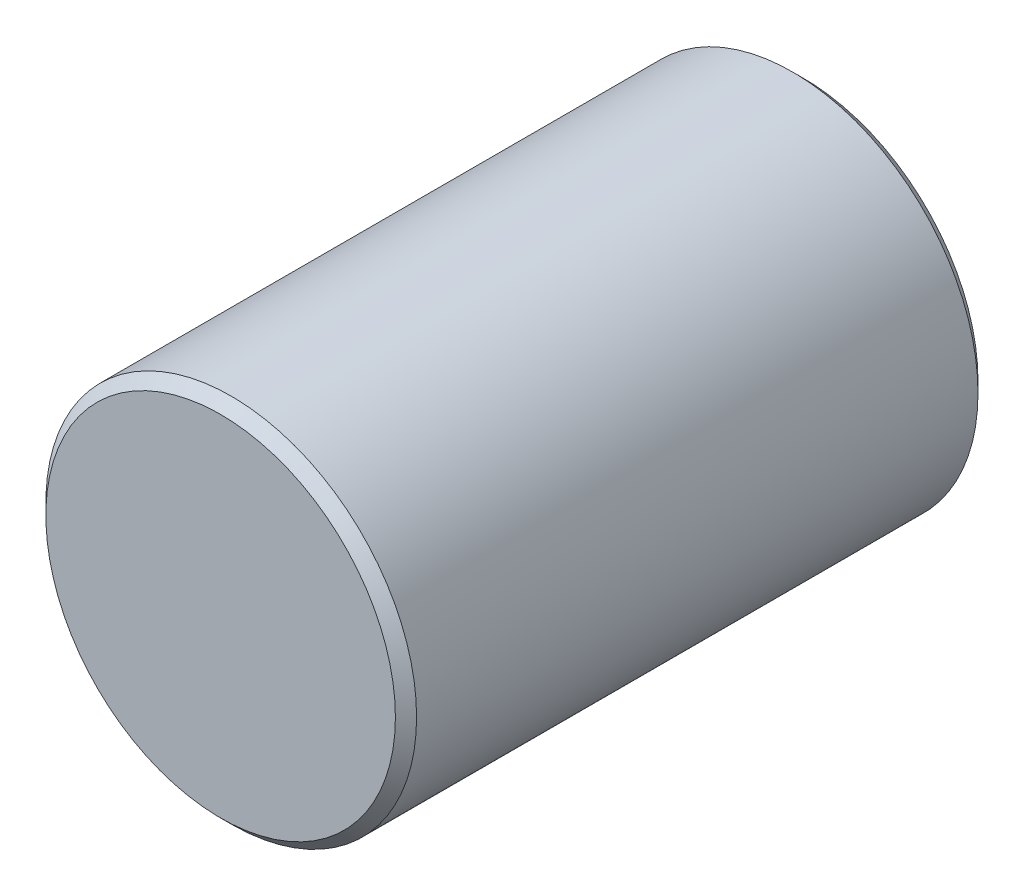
ISO-10303-21;
HEADER;
FILE_DESCRIPTION(('STEP AP214'),'2;1');
FILE_NAME('part.step','',(''),(''),'','','');
FILE_SCHEMA(('AUTOMOTIVE_DESIGN { 1 0 10303 214 1 1 1 1 }'));
ENDSEC;
DATA;
#1=APPLICATION_CONTEXT('core data for automotive mechanical design processes');
#2=APPLICATION_PROTOCOL_DEFINITION('international standard','automotive_design',2000,#1);
#3=PRODUCT_CONTEXT('',#1,'mechanical');
#4=PRODUCT('Part','Part','',(#3));
#5=PRODUCT_RELATED_PRODUCT_CATEGORY('part','',(#4));
#6=PRODUCT_DEFINITION_FORMATION('','',#4);
#7=PRODUCT_DEFINITION_CONTEXT('part definition',#1,'design');
#8=PRODUCT_DEFINITION('design','',#6,#7);
#9=PRODUCT_DEFINITION_SHAPE('','',#8);
#10=(LENGTH_UNIT() NAMED_UNIT(*) SI_UNIT(.MILLI.,.METRE.));
#11=(NAMED_UNIT(*) PLANE_ANGLE_UNIT() SI_UNIT($,.RADIAN.));
#12=(NAMED_UNIT(*) SI_UNIT($,.STERADIAN.) SOLID_ANGLE_UNIT());
#13=UNCERTAINTY_MEASURE_WITH_UNIT(LENGTH_MEASURE(1.E-05),#10,'distance_accuracy_value','');
#14=(GEOMETRIC_REPRESENTATION_CONTEXT(3) GLOBAL_UNCERTAINTY_ASSIGNED_CONTEXT((#13)) GLOBAL_UNIT_ASSIGNED_CONTEXT((#10,
#11,#12)) REPRESENTATION_CONTEXT('',''));
#15=CARTESIAN_POINT('',(0.,0.,0.));
#16=DIRECTION('',(0.,0.,1.));
#17=DIRECTION('',(1.,0.,0.));
#18=AXIS2_PLACEMENT_3D('',#15,#16,#17);
#19=CARTESIAN_POINT('',(0.,0.,55.));
#20=DIRECTION('',(0.,0.,-1.));
#21=DIRECTION('',(-1.,0.,0.));
#22=AXIS2_PLACEMENT_3D('',#19,#20,#21);
#23=CYLINDRICAL_SURFACE('',#22,17.5);
#24=CARTESIAN_POINT('',(0.,0.,1.00000000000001));
#25=DIRECTION('',(0.,0.,1.));
#26=DIRECTION('',(1.,0.,0.));
#27=AXIS2_PLACEMENT_3D('',#24,#25,#26);
#28=CIRCLE('',#27,17.5);
#29=CARTESIAN_POINT('',(17.5,0.,1.00000000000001));
#30=VERTEX_POINT('',#29);
#31=EDGE_CURVE('E69',#30,#30,#28,.T.);
#32=ORIENTED_EDGE('',*,*,#31,.T.);
#33=EDGE_LOOP('',(#32));
#34=FACE_BOUND('',#33,.T.);
#35=CARTESIAN_POINT('',(0.,0.,54.));
#36=DIRECTION('',(0.,0.,1.));
#37=DIRECTION('',(1.,0.,0.));
#38=AXIS2_PLACEMENT_3D('',#35,#36,#37);
#39=CIRCLE('',#38,17.5);
#40=CARTESIAN_POINT('',(17.5,0.,54.));
#41=VERTEX_POINT('',#40);
#42=EDGE_CURVE('E63',#41,#41,#39,.F.);
#43=ORIENTED_EDGE('',*,*,#42,.T.);
#44=EDGE_LOOP('',(#43));
#45=FACE_BOUND('',#44,.T.);
#46=ADVANCED_FACE('F38',(#34,#45),#23,.T.);
#47=CARTESIAN_POINT('',(0.,0.,55.));
#48=DIRECTION('',(0.,0.,1.));
#49=DIRECTION('',(1.,0.,0.));
#50=AXIS2_PLACEMENT_3D('',#47,#48,#49);
#51=PLANE('',#50);
#52=CARTESIAN_POINT('',(0.,0.,55.));
#53=DIRECTION('',(0.,0.,1.));
#54=DIRECTION('',(1.,0.,0.));
#55=AXIS2_PLACEMENT_3D('',#52,#53,#54);
#56=CIRCLE('',#55,16.5);
#57=CARTESIAN_POINT('',(16.5,0.,55.));
#58=VERTEX_POINT('',#57);
#59=EDGE_CURVE('E11',#58,#58,#56,.T.);
#60=ORIENTED_EDGE('',*,*,#59,.T.);
#61=EDGE_LOOP('',(#60));
#62=FACE_BOUND('',#61,.T.);
#63=ADVANCED_FACE('F85',(#62),#51,.T.);
#64=CARTESIAN_POINT('',(0.,0.,0.));
#65=DIRECTION('',(0.,0.,1.));
#66=DIRECTION('',(1.,0.,0.));
#67=AXIS2_PLACEMENT_3D('',#64,#65,#66);
#68=PLANE('',#67);
#69=CARTESIAN_POINT('',(0.,0.,0.));
#70=DIRECTION('',(0.,0.,-1.));
#71=DIRECTION('',(-1.,0.,0.));
#72=AXIS2_PLACEMENT_3D('',#69,#70,#71);
#73=CIRCLE('',#72,2.49999999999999);
#74=CARTESIAN_POINT('',(-2.49999999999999,0.,0.));
#75=VERTEX_POINT('',#74);
#76=EDGE_CURVE('E59',#75,#75,#73,.T.);
#77=ORIENTED_EDGE('',*,*,#76,.F.);
#78=EDGE_LOOP('',(#77));
#79=FACE_BOUND('',#78,.T.);
#80=CARTESIAN_POINT('',(0.,0.,0.));
#81=DIRECTION('',(0.,0.,1.));
#82=DIRECTION('',(1.,0.,0.));
#83=AXIS2_PLACEMENT_3D('',#80,#81,#82);
#84=CIRCLE('',#83,16.5);
#85=CARTESIAN_POINT('',(16.5,0.,0.));
#86=VERTEX_POINT('',#85);
#87=EDGE_CURVE('E46',#86,#86,#84,.F.);
#88=ORIENTED_EDGE('',*,*,#87,.T.);
#89=EDGE_LOOP('',(#88));
#90=FACE_BOUND('',#89,.T.);
#91=ADVANCED_FACE('F76',(#79,#90),#68,.F.);
#92=CARTESIAN_POINT('',(0.,0.,1.00000000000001));
#93=DIRECTION('',(0.,0.,1.));
#94=DIRECTION('',(1.,0.,0.));
#95=AXIS2_PLACEMENT_3D('',#92,#93,#94);
#96=CONICAL_SURFACE('',#95,17.5,0.785398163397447);
#97=ORIENTED_EDGE('',*,*,#87,.F.);
#98=EDGE_LOOP('',(#97));
#99=FACE_BOUND('',#98,.T.);
#100=ORIENTED_EDGE('',*,*,#31,.F.);
#101=EDGE_LOOP('',(#100));
#102=FACE_BOUND('',#101,.T.);
#103=ADVANCED_FACE('F78',(#99,#102),#96,.T.);
#104=CARTESIAN_POINT('',(0.,0.,55.));
#105=DIRECTION('',(0.,0.,-1.));
#106=DIRECTION('',(-1.,0.,0.));
#107=AXIS2_PLACEMENT_3D('',#104,#105,#106);
#108=CONICAL_SURFACE('',#107,16.5,0.785398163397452);
#109=ORIENTED_EDGE('',*,*,#42,.F.);
#110=EDGE_LOOP('',(#109));
#111=FACE_BOUND('',#110,.T.);
#112=ORIENTED_EDGE('',*,*,#59,.F.);
#113=EDGE_LOOP('',(#112));
#114=FACE_BOUND('',#113,.T.);
#115=ADVANCED_FACE('F40',(#111,#114),#108,.T.);
#116=CARTESIAN_POINT('',(0.,0.,0.));
#117=DIRECTION('',(0.,0.,-1.));
#118=DIRECTION('',(-1.,0.,0.));
#119=AXIS2_PLACEMENT_3D('',#116,#117,#118);
#120=CYLINDRICAL_SURFACE('',#119,2.49999999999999);
#121=CARTESIAN_POINT('',(0.,0.,15.));
#122=DIRECTION('',(0.,0.,-1.));
#123=DIRECTION('',(-1.,0.,0.));
#124=AXIS2_PLACEMENT_3D('',#121,#122,#123);
#125=CIRCLE('',#124,2.49999999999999);
#126=CARTESIAN_POINT('',(-2.49999999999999,0.,15.));
#127=VERTEX_POINT('',#126);
#128=EDGE_CURVE('E56',#127,#127,#125,.T.);
#129=ORIENTED_EDGE('',*,*,#128,.F.);
#130=EDGE_LOOP('',(#129));
#131=FACE_BOUND('',#130,.T.);
#132=ORIENTED_EDGE('',*,*,#76,.T.);
#133=EDGE_LOOP('',(#132));
#134=FACE_BOUND('',#133,.T.);
#135=ADVANCED_FACE('F52',(#131,#134),#120,.F.);
#136=CARTESIAN_POINT('',(0.,0.,15.));
#137=DIRECTION('',(0.,0.,-1.));
#138=DIRECTION('',(-1.,0.,0.));
#139=AXIS2_PLACEMENT_3D('',#136,#137,#138);
#140=CONICAL_SURFACE('',#139,2.49999999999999,1.02974425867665);
#141=CARTESIAN_POINT('',(0.,0.,16.5021515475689));
#142=VERTEX_POINT('',#141);
#143=VERTEX_LOOP('',#142);
#144=FACE_BOUND('',#143,.T.);
#145=ORIENTED_EDGE('',*,*,#128,.T.);
#146=EDGE_LOOP('',(#145));
#147=FACE_BOUND('',#146,.T.);
#148=ADVANCED_FACE('F49',(#144,#147),#140,.F.);
#149=CLOSED_SHELL('',(#46,#63,#91,#103,#115,#135,#148));
#150=MANIFOLD_SOLID_BREP('B2',#149);
#151=ADVANCED_BREP_SHAPE_REPRESENTATION('',(#18,#150),#14);
#152=SHAPE_DEFINITION_REPRESENTATION(#9,#151);
ENDSEC;
END-ISO-10303-21;
